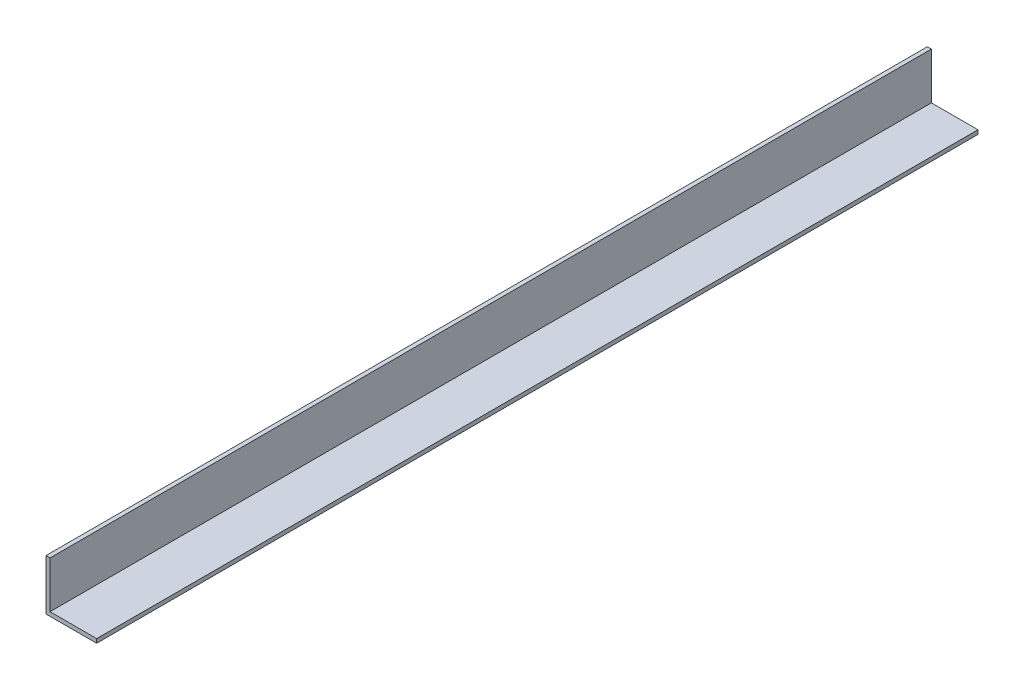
from build123d import *

# Parameters (mm, degrees)
BASE_EXTRUSION_DEPTH = 870


with BuildPart() as part:
    # Esquisse1 → Base-Extrusion (new body)
    with BuildSketch(Plane.XY):
        Polygon((0, 50), (0, 0), (50, 0), (50, 4), (4, 4), (4, 50), align=None)
    extrude(amount=-BASE_EXTRUSION_DEPTH)


solid = part.part
